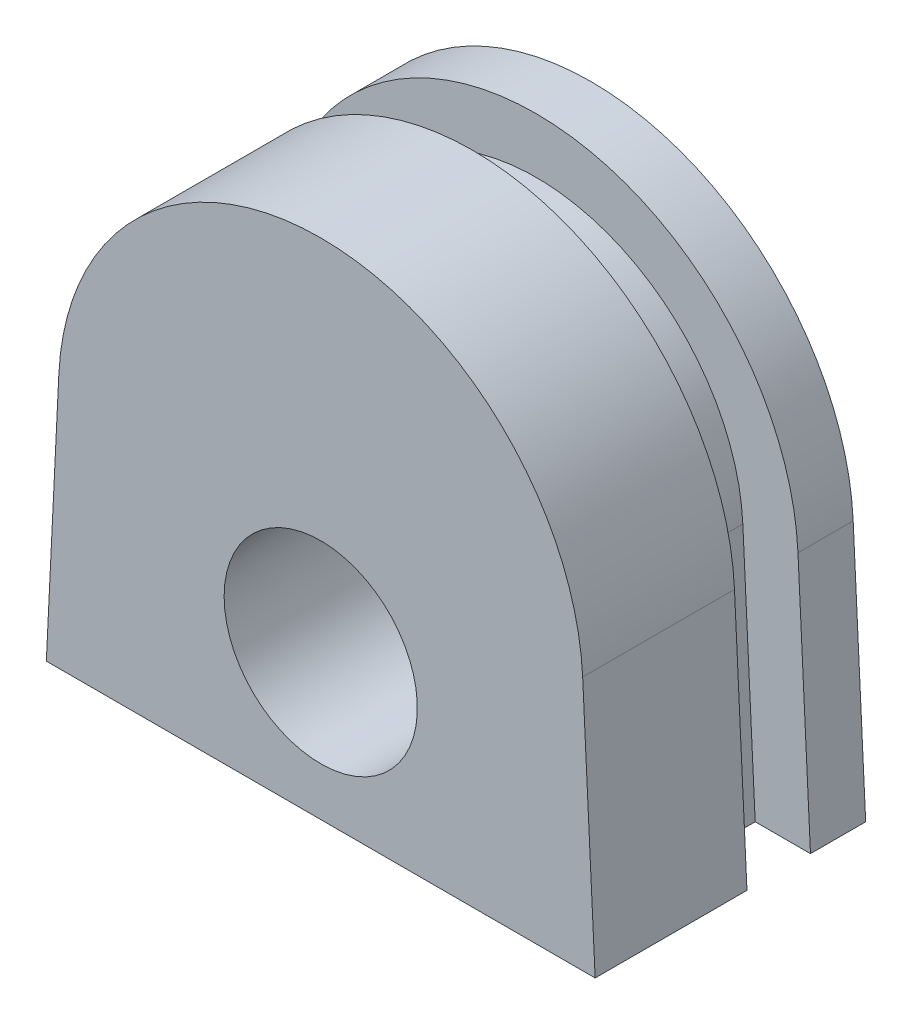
from build123d import *

# Parameters (mm, degrees)
BASE_EXTRUSION_DEPTH    = 2.3
BOSS_EXTRU_1_DEPTH      = 5.5
BOSS_EXTRU_2_START      = 2
BOSS_EXTRU_2_DEPTH      = 2
ESQUISSE4_R             = 3.5
ENL_V_MAT_EXTRU_1_DEPTH = 31.140423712


with BuildPart() as part:
    # Esquisse1 → Base-Extrusion (new body)
    with BuildSketch(Plane.XY):
        with BuildLine():
            Line((-21.740977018, 5.94089707), (-22.188629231, -3.176884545))
            Line((-22.188629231, -3.176884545), (-6.311370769, -3.176884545))
            Line((-6.311370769, -3.176884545), (-6.759022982, 5.94089707))
            ThreePointArc((-6.759022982, 5.94089707), (-14.25, 13.073115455), (-21.740977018, 5.94089707))
        make_face()
    extrude(amount=-BASE_EXTRUSION_DEPTH)

    # Esquisse2 → Boss.-Extru.1 (add)
    with BuildSketch(Plane.XY):
        with BuildLine():
            Line((-4.308961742, -3.176884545), (-24.191038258, -3.176884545))
            Line((-24.191038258, -3.176884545), (-23.738570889, 6.038972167))
            ThreePointArc((-23.738570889, 6.038972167), (-14.25, 15.073115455), (-4.761429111, 6.038972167))
            Line((-4.761429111, 6.038972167), (-4.308961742, -3.176884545))
        make_face()
    extrude(amount=BOSS_EXTRU_1_DEPTH)

    # Esquisse3 → Boss.-Extru.2 (add)
    with BuildSketch(Plane(origin=(0, 0, -2.3), x_dir=(-1, 0, 0), z_dir=(0, 0, -1)).offset(BOSS_EXTRU_2_START)):
        with BuildLine():
            Line((4.761429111, 6.038972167), (4.308961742, -3.176884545))
            Line((4.308961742, -3.176884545), (24.191038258, -3.176884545))
            Line((24.191038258, -3.176884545), (23.738570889, 6.038972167))
            ThreePointArc((23.738570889, 6.038972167), (14.25, 15.073115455), (4.761429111, 6.038972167))
        make_face()
    extrude(amount=-BOSS_EXTRU_2_DEPTH)

    # Esquisse4 → Enl_v. mat.-Extru.1 (cut, through all)
    with BuildSketch(Plane(origin=(0, 0, -4.3), x_dir=(-1, 0, 0), z_dir=(0, 0, -1))):
        with Locations((14.25, 2.073115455)):
            Circle(ESQUISSE4_R)
    extrude(amount=-ENL_V_MAT_EXTRU_1_DEPTH, mode=Mode.SUBTRACT)


solid = part.part
